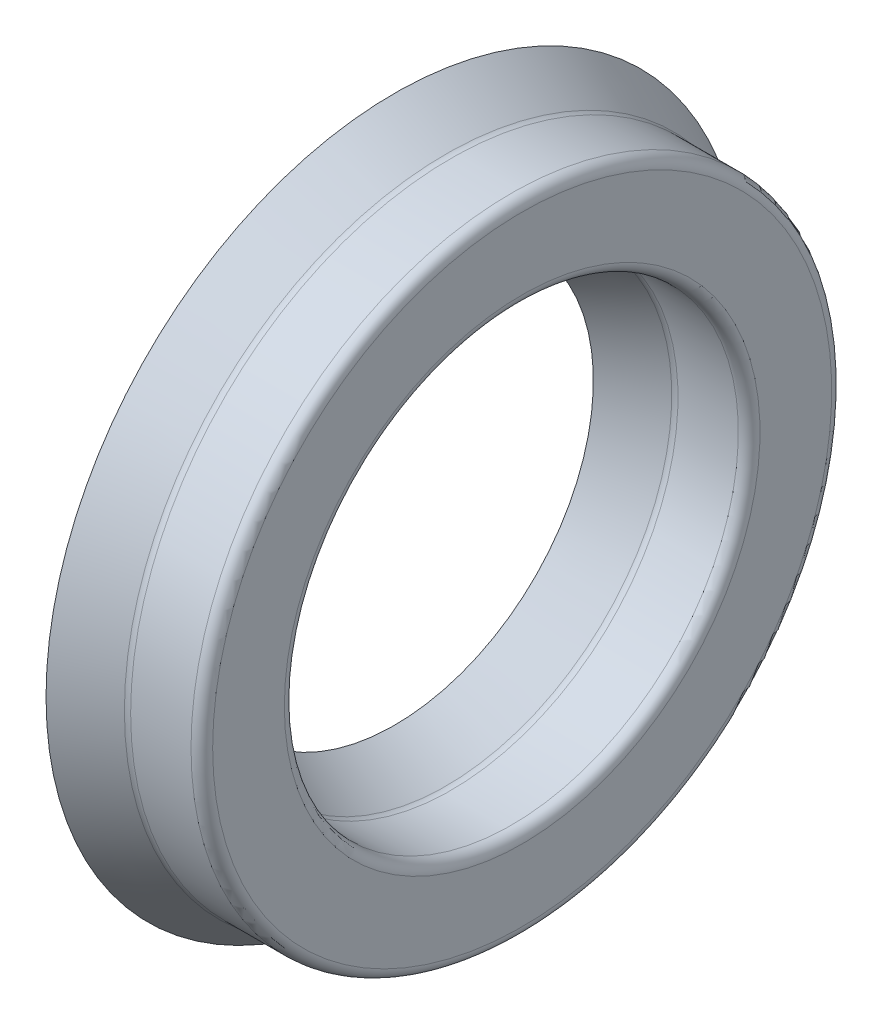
ISO-10303-21;
HEADER;
FILE_DESCRIPTION(('STEP AP214'),'2;1');
FILE_NAME('part.step','',(''),(''),'','','');
FILE_SCHEMA(('AUTOMOTIVE_DESIGN { 1 0 10303 214 1 1 1 1 }'));
ENDSEC;
DATA;
#1=APPLICATION_CONTEXT('core data for automotive mechanical design processes');
#2=APPLICATION_PROTOCOL_DEFINITION('international standard','automotive_design',2000,#1);
#3=PRODUCT_CONTEXT('',#1,'mechanical');
#4=PRODUCT('Part','Part','',(#3));
#5=PRODUCT_RELATED_PRODUCT_CATEGORY('part','',(#4));
#6=PRODUCT_DEFINITION_FORMATION('','',#4);
#7=PRODUCT_DEFINITION_CONTEXT('part definition',#1,'design');
#8=PRODUCT_DEFINITION('design','',#6,#7);
#9=PRODUCT_DEFINITION_SHAPE('','',#8);
#10=(LENGTH_UNIT() NAMED_UNIT(*) SI_UNIT(.MILLI.,.METRE.));
#11=(NAMED_UNIT(*) PLANE_ANGLE_UNIT() SI_UNIT($,.RADIAN.));
#12=(NAMED_UNIT(*) SI_UNIT($,.STERADIAN.) SOLID_ANGLE_UNIT());
#13=UNCERTAINTY_MEASURE_WITH_UNIT(LENGTH_MEASURE(1.E-05),#10,'distance_accuracy_value','');
#14=(GEOMETRIC_REPRESENTATION_CONTEXT(3) GLOBAL_UNCERTAINTY_ASSIGNED_CONTEXT((#13)) GLOBAL_UNIT_ASSIGNED_CONTEXT((#10,
#11,#12)) REPRESENTATION_CONTEXT('',''));
#15=CARTESIAN_POINT('',(0.,0.,0.));
#16=DIRECTION('',(0.,0.,1.));
#17=DIRECTION('',(1.,0.,0.));
#18=AXIS2_PLACEMENT_3D('',#15,#16,#17);
#19=CARTESIAN_POINT('',(-0.857129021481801,0.,0.));
#20=DIRECTION('',(1.,0.,0.));
#21=DIRECTION('',(0.,0.,-1.));
#22=AXIS2_PLACEMENT_3D('',#19,#20,#21);
#23=CONICAL_SURFACE('',#22,5.5626,1.08941892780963);
#24=CARTESIAN_POINT('',(-1.18110000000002,0.,0.));
#25=DIRECTION('',(-1.,0.,0.));
#26=DIRECTION('',(0.,0.,1.));
#27=AXIS2_PLACEMENT_3D('',#24,#25,#26);
#28=CIRCLE('',#27,4.942397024);
#29=CARTESIAN_POINT('',(-1.18110000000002,0.,4.942397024));
#30=VERTEX_POINT('',#29);
#31=EDGE_CURVE('E10',#30,#30,#28,.T.);
#32=ORIENTED_EDGE('',*,*,#31,.F.);
#33=EDGE_LOOP('',(#32));
#34=FACE_BOUND('',#33,.T.);
#35=CARTESIAN_POINT('',(-0.857129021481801,0.,0.));
#36=DIRECTION('',(-1.,0.,0.));
#37=DIRECTION('',(0.,0.,1.));
#38=AXIS2_PLACEMENT_3D('',#35,#36,#37);
#39=CIRCLE('',#38,5.5626);
#40=CARTESIAN_POINT('',(-0.857129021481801,0.,5.5626));
#41=VERTEX_POINT('',#40);
#42=EDGE_CURVE('E100',#41,#41,#39,.T.);
#43=ORIENTED_EDGE('',*,*,#42,.T.);
#44=EDGE_LOOP('',(#43));
#45=FACE_BOUND('',#44,.T.);
#46=ADVANCED_FACE('F39',(#34,#45),#23,.T.);
#47=CARTESIAN_POINT('',(-1.18110000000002,0.,0.));
#48=DIRECTION('',(-1.,0.,0.));
#49=DIRECTION('',(0.,0.,1.));
#50=AXIS2_PLACEMENT_3D('',#47,#48,#49);
#51=CONICAL_SURFACE('',#50,4.942397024,0.48137739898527);
#52=CARTESIAN_POINT('',(-0.376270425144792,0.,0.));
#53=DIRECTION('',(-1.,0.,0.));
#54=DIRECTION('',(0.,0.,1.));
#55=AXIS2_PLACEMENT_3D('',#52,#53,#54);
#56=CIRCLE('',#55,4.52198397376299);
#57=CARTESIAN_POINT('',(-0.376270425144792,0.,4.521983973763));
#58=VERTEX_POINT('',#57);
#59=EDGE_CURVE('E46',#58,#58,#56,.T.);
#60=ORIENTED_EDGE('',*,*,#59,.F.);
#61=EDGE_LOOP('',(#60));
#62=FACE_BOUND('',#61,.T.);
#63=ORIENTED_EDGE('',*,*,#31,.T.);
#64=EDGE_LOOP('',(#63));
#65=FACE_BOUND('',#64,.T.);
#66=ADVANCED_FACE('F175',(#62,#65),#51,.F.);
#67=CARTESIAN_POINT('',(-0.456288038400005,0.,0.));
#68=DIRECTION('',(-1.,0.,0.));
#69=DIRECTION('',(0.,0.,1.));
#70=AXIS2_PLACEMENT_3D('',#67,#68,#69);
#71=TOROIDAL_SURFACE('',#70,4.3688,0.172824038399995);
#72=CARTESIAN_POINT('',(-0.376270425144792,0.,0.));
#73=DIRECTION('',(-1.,0.,0.));
#74=DIRECTION('',(0.,0.,1.));
#75=AXIS2_PLACEMENT_3D('',#72,#73,#74);
#76=CIRCLE('',#75,4.21561602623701);
#77=CARTESIAN_POINT('',(-0.376270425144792,0.,4.21561602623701));
#78=VERTEX_POINT('',#77);
#79=EDGE_CURVE('E52',#78,#78,#76,.T.);
#80=ORIENTED_EDGE('',*,*,#79,.F.);
#81=EDGE_LOOP('',(#80));
#82=FACE_BOUND('',#81,.T.);
#83=ORIENTED_EDGE('',*,*,#59,.T.);
#84=EDGE_LOOP('',(#83));
#85=FACE_BOUND('',#84,.T.);
#86=ADVANCED_FACE('F170',(#82,#85),#71,.F.);
#87=CARTESIAN_POINT('',(-0.376270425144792,0.,0.));
#88=DIRECTION('',(1.,0.,0.));
#89=DIRECTION('',(0.,0.,-1.));
#90=AXIS2_PLACEMENT_3D('',#87,#88,#89);
#91=CONICAL_SURFACE('',#90,4.21561602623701,0.481377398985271);
#92=CARTESIAN_POINT('',(-1.18110000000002,0.,0.));
#93=DIRECTION('',(-1.,0.,0.));
#94=DIRECTION('',(0.,0.,1.));
#95=AXIS2_PLACEMENT_3D('',#92,#93,#94);
#96=CIRCLE('',#95,3.795202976);
#97=CARTESIAN_POINT('',(-1.18110000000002,0.,3.795202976));
#98=VERTEX_POINT('',#97);
#99=EDGE_CURVE('E58',#98,#98,#96,.T.);
#100=ORIENTED_EDGE('',*,*,#99,.F.);
#101=EDGE_LOOP('',(#100));
#102=FACE_BOUND('',#101,.T.);
#103=ORIENTED_EDGE('',*,*,#79,.T.);
#104=EDGE_LOOP('',(#103));
#105=FACE_BOUND('',#104,.T.);
#106=ADVANCED_FACE('F164',(#102,#105),#91,.T.);
#107=CARTESIAN_POINT('',(-1.18110000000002,0.,0.));
#108=DIRECTION('',(-1.,0.,0.));
#109=DIRECTION('',(0.,0.,1.));
#110=AXIS2_PLACEMENT_3D('',#107,#108,#109);
#111=CONICAL_SURFACE('',#110,3.795202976,1.08941892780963);
#112=CARTESIAN_POINT('',(-0.857129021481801,0.,0.));
#113=DIRECTION('',(-1.,0.,0.));
#114=DIRECTION('',(0.,0.,1.));
#115=AXIS2_PLACEMENT_3D('',#112,#113,#114);
#116=CIRCLE('',#115,3.175);
#117=CARTESIAN_POINT('',(-0.857129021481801,0.,3.175));
#118=VERTEX_POINT('',#117);
#119=EDGE_CURVE('E64',#118,#118,#116,.T.);
#120=ORIENTED_EDGE('',*,*,#119,.F.);
#121=EDGE_LOOP('',(#120));
#122=FACE_BOUND('',#121,.T.);
#123=ORIENTED_EDGE('',*,*,#99,.T.);
#124=EDGE_LOOP('',(#123));
#125=FACE_BOUND('',#124,.T.);
#126=ADVANCED_FACE('F158',(#122,#125),#111,.F.);
#127=CARTESIAN_POINT('',(-0.857129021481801,0.,0.));
#128=DIRECTION('',(1.,0.,0.));
#129=DIRECTION('',(0.,0.,-1.));
#130=AXIS2_PLACEMENT_3D('',#127,#128,#129);
#131=CONICAL_SURFACE('',#130,3.175,0.481377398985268);
#132=CARTESIAN_POINT('',(-0.0354228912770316,0.,0.));
#133=DIRECTION('',(-1.,0.,0.));
#134=DIRECTION('',(0.,0.,1.));
#135=AXIS2_PLACEMENT_3D('',#132,#133,#134);
#136=CIRCLE('',#135,3.604228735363);
#137=CARTESIAN_POINT('',(-0.0354228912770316,0.,3.604228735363));
#138=VERTEX_POINT('',#137);
#139=EDGE_CURVE('E68',#138,#138,#136,.T.);
#140=ORIENTED_EDGE('',*,*,#139,.F.);
#141=EDGE_LOOP('',(#140));
#142=FACE_BOUND('',#141,.T.);
#143=ORIENTED_EDGE('',*,*,#119,.T.);
#144=EDGE_LOOP('',(#143));
#145=FACE_BOUND('',#144,.T.);
#146=ADVANCED_FACE('F152',(#142,#145),#131,.F.);
#147=CARTESIAN_POINT('',(0.0445947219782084,0.,0.));
#148=DIRECTION('',(-1.,0.,0.));
#149=DIRECTION('',(0.,0.,1.));
#150=AXIS2_PLACEMENT_3D('',#147,#148,#149);
#151=TOROIDAL_SURFACE('',#150,3.4510447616,0.172824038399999);
#152=CARTESIAN_POINT('',(0.0445947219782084,0.,0.));
#153=DIRECTION('',(-1.,0.,0.));
#154=DIRECTION('',(0.,0.,1.));
#155=AXIS2_PLACEMENT_3D('',#152,#153,#154);
#156=CIRCLE('',#155,3.6238688);
#157=CARTESIAN_POINT('',(0.0445947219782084,0.,3.6238688));
#158=VERTEX_POINT('',#157);
#159=EDGE_CURVE('E72',#158,#158,#156,.T.);
#160=ORIENTED_EDGE('',*,*,#159,.F.);
#161=EDGE_LOOP('',(#160));
#162=FACE_BOUND('',#161,.T.);
#163=ORIENTED_EDGE('',*,*,#139,.T.);
#164=EDGE_LOOP('',(#163));
#165=FACE_BOUND('',#164,.T.);
#166=ADVANCED_FACE('F146',(#162,#165),#151,.F.);
#167=CARTESIAN_POINT('',(-1.18110000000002,0.,0.));
#168=DIRECTION('',(-1.,0.,0.));
#169=DIRECTION('',(0.,0.,1.));
#170=AXIS2_PLACEMENT_3D('',#167,#168,#169);
#171=CYLINDRICAL_SURFACE('',#170,3.6238688);
#172=CARTESIAN_POINT('',(1.0082759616,0.,0.));
#173=DIRECTION('',(-1.,0.,0.));
#174=DIRECTION('',(0.,0.,1.));
#175=AXIS2_PLACEMENT_3D('',#172,#173,#174);
#176=CIRCLE('',#175,3.6238688);
#177=CARTESIAN_POINT('',(1.0082759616,0.,3.6238688));
#178=VERTEX_POINT('',#177);
#179=EDGE_CURVE('E76',#178,#178,#176,.T.);
#180=ORIENTED_EDGE('',*,*,#179,.F.);
#181=EDGE_LOOP('',(#180));
#182=FACE_BOUND('',#181,.T.);
#183=ORIENTED_EDGE('',*,*,#159,.T.);
#184=EDGE_LOOP('',(#183));
#185=FACE_BOUND('',#184,.T.);
#186=ADVANCED_FACE('F140',(#182,#185),#171,.F.);
#187=CARTESIAN_POINT('',(1.0082759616,0.,0.));
#188=DIRECTION('',(-1.,0.,0.));
#189=DIRECTION('',(0.,0.,1.));
#190=AXIS2_PLACEMENT_3D('',#187,#188,#189);
#191=TOROIDAL_SURFACE('',#190,3.7966928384,0.1728240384);
#192=CARTESIAN_POINT('',(1.18110000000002,0.,0.));
#193=DIRECTION('',(-1.,0.,0.));
#194=DIRECTION('',(0.,0.,1.));
#195=AXIS2_PLACEMENT_3D('',#192,#193,#194);
#196=CIRCLE('',#195,3.7966928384);
#197=CARTESIAN_POINT('',(1.18110000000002,0.,3.7966928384));
#198=VERTEX_POINT('',#197);
#199=EDGE_CURVE('E80',#198,#198,#196,.T.);
#200=ORIENTED_EDGE('',*,*,#199,.F.);
#201=EDGE_LOOP('',(#200));
#202=FACE_BOUND('',#201,.T.);
#203=ORIENTED_EDGE('',*,*,#179,.T.);
#204=EDGE_LOOP('',(#203));
#205=FACE_BOUND('',#204,.T.);
#206=ADVANCED_FACE('F134',(#202,#205),#191,.T.);
#207=CARTESIAN_POINT('',(1.18109999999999,4.94090716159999,0.));
#208=DIRECTION('',(-1.,0.,0.));
#209=DIRECTION('',(0.,0.,1.));
#210=AXIS2_PLACEMENT_3D('',#207,#208,#209);
#211=PLANE('',#210);
#212=CARTESIAN_POINT('',(1.18110000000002,0.,0.));
#213=DIRECTION('',(-1.,0.,0.));
#214=DIRECTION('',(0.,0.,1.));
#215=AXIS2_PLACEMENT_3D('',#212,#213,#214);
#216=CIRCLE('',#215,4.9409071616);
#217=CARTESIAN_POINT('',(1.18110000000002,0.,4.9409071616));
#218=VERTEX_POINT('',#217);
#219=EDGE_CURVE('E84',#218,#218,#216,.T.);
#220=ORIENTED_EDGE('',*,*,#219,.F.);
#221=EDGE_LOOP('',(#220));
#222=FACE_BOUND('',#221,.T.);
#223=ORIENTED_EDGE('',*,*,#199,.T.);
#224=EDGE_LOOP('',(#223));
#225=FACE_BOUND('',#224,.T.);
#226=ADVANCED_FACE('F128',(#222,#225),#211,.F.);
#227=CARTESIAN_POINT('',(1.0082759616,0.,0.));
#228=DIRECTION('',(-1.,0.,0.));
#229=DIRECTION('',(0.,0.,1.));
#230=AXIS2_PLACEMENT_3D('',#227,#228,#229);
#231=TOROIDAL_SURFACE('',#230,4.9409071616,0.172824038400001);
#232=CARTESIAN_POINT('',(1.0082759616,0.,0.));
#233=DIRECTION('',(-1.,0.,0.));
#234=DIRECTION('',(0.,0.,1.));
#235=AXIS2_PLACEMENT_3D('',#232,#233,#234);
#236=CIRCLE('',#235,5.1137312);
#237=CARTESIAN_POINT('',(1.0082759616,0.,5.1137312));
#238=VERTEX_POINT('',#237);
#239=EDGE_CURVE('E88',#238,#238,#236,.T.);
#240=ORIENTED_EDGE('',*,*,#239,.F.);
#241=EDGE_LOOP('',(#240));
#242=FACE_BOUND('',#241,.T.);
#243=ORIENTED_EDGE('',*,*,#219,.T.);
#244=EDGE_LOOP('',(#243));
#245=FACE_BOUND('',#244,.T.);
#246=ADVANCED_FACE('F122',(#242,#245),#231,.T.);
#247=CARTESIAN_POINT('',(-1.18110000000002,0.,0.));
#248=DIRECTION('',(-1.,0.,0.));
#249=DIRECTION('',(0.,0.,1.));
#250=AXIS2_PLACEMENT_3D('',#247,#248,#249);
#251=CYLINDRICAL_SURFACE('',#250,5.1137312);
#252=CARTESIAN_POINT('',(0.0445947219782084,0.,0.));
#253=DIRECTION('',(-1.,0.,0.));
#254=DIRECTION('',(0.,0.,1.));
#255=AXIS2_PLACEMENT_3D('',#252,#253,#254);
#256=CIRCLE('',#255,5.1137312);
#257=CARTESIAN_POINT('',(0.0445947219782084,0.,5.1137312));
#258=VERTEX_POINT('',#257);
#259=EDGE_CURVE('E92',#258,#258,#256,.T.);
#260=ORIENTED_EDGE('',*,*,#259,.F.);
#261=EDGE_LOOP('',(#260));
#262=FACE_BOUND('',#261,.T.);
#263=ORIENTED_EDGE('',*,*,#239,.T.);
#264=EDGE_LOOP('',(#263));
#265=FACE_BOUND('',#264,.T.);
#266=ADVANCED_FACE('F116',(#262,#265),#251,.T.);
#267=CARTESIAN_POINT('',(0.0445947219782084,0.,0.));
#268=DIRECTION('',(-1.,0.,0.));
#269=DIRECTION('',(0.,0.,1.));
#270=AXIS2_PLACEMENT_3D('',#267,#268,#269);
#271=TOROIDAL_SURFACE('',#270,5.2865552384,0.172824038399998);
#272=CARTESIAN_POINT('',(-0.0354228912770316,0.,0.));
#273=DIRECTION('',(-1.,0.,0.));
#274=DIRECTION('',(0.,0.,1.));
#275=AXIS2_PLACEMENT_3D('',#272,#273,#274);
#276=CIRCLE('',#275,5.133371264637);
#277=CARTESIAN_POINT('',(-0.0354228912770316,0.,5.133371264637));
#278=VERTEX_POINT('',#277);
#279=EDGE_CURVE('E96',#278,#278,#276,.T.);
#280=ORIENTED_EDGE('',*,*,#279,.F.);
#281=EDGE_LOOP('',(#280));
#282=FACE_BOUND('',#281,.T.);
#283=ORIENTED_EDGE('',*,*,#259,.T.);
#284=EDGE_LOOP('',(#283));
#285=FACE_BOUND('',#284,.T.);
#286=ADVANCED_FACE('F110',(#282,#285),#271,.F.);
#287=CARTESIAN_POINT('',(-0.0354228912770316,0.,0.));
#288=DIRECTION('',(-1.,0.,0.));
#289=DIRECTION('',(0.,0.,1.));
#290=AXIS2_PLACEMENT_3D('',#287,#288,#289);
#291=CONICAL_SURFACE('',#290,5.133371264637,0.481377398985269);
#292=ORIENTED_EDGE('',*,*,#42,.F.);
#293=EDGE_LOOP('',(#292));
#294=FACE_BOUND('',#293,.T.);
#295=ORIENTED_EDGE('',*,*,#279,.T.);
#296=EDGE_LOOP('',(#295));
#297=FACE_BOUND('',#296,.T.);
#298=ADVANCED_FACE('F107',(#294,#297),#291,.T.);
#299=CLOSED_SHELL('',(#46,#66,#86,#106,#126,#146,#166,#186,#206,#226,#246,#266,#286,#298));
#300=MANIFOLD_SOLID_BREP('B2',#299);
#301=ADVANCED_BREP_SHAPE_REPRESENTATION('',(#18,#300),#14);
#302=SHAPE_DEFINITION_REPRESENTATION(#9,#301);
ENDSEC;
END-ISO-10303-21;
